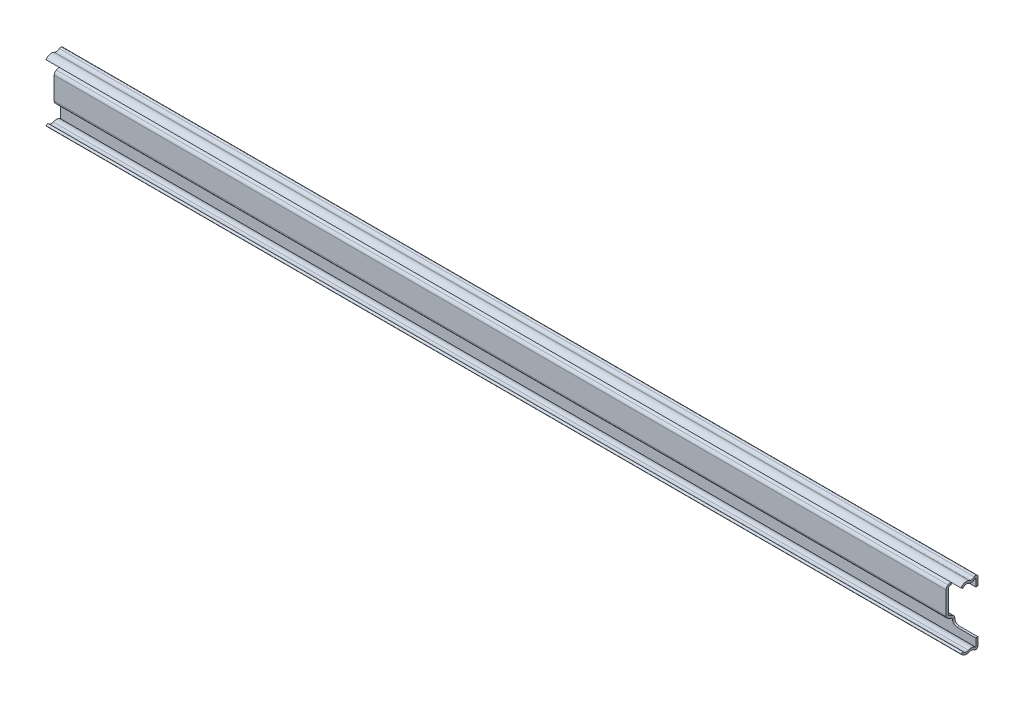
from build123d import *

# Parameters (mm, degrees)
BOSS_EXTRUDE1_DEPTH = 500.126
SKETCH2_W           = 12.7
SKETCH2_H           = 24.13
CUT_EXTRUDE1_DEPTH  = 505.455221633
SKETCH3_W           = 487.426
SKETCH3_H           = 14.75620072
BOSS_EXTRUDE2_DEPTH = 3.55599999
SKETCH4_W           = 3.55599999
SKETCH4_H           = 13.202768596
CUT_EXTRUDE2_DEPTH  = 501.46835993
DRAFT1_ANGLE        = 25
DRAFT2_ANGLE        = 25
FILLET1_R           = 0.76200009
FILLET2_R           = 1.98120009
FILLET3_R           = 2.54


with BuildPart() as part:
    # Sketch1 → Boss-Extrude1 (new body)
    with BuildSketch(Plane(origin=(-3.937, 0, 0), x_dir=(0, 0, -1), z_dir=(1, 0, 0))):
        with BuildLine():
            Line((2.311399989, 16.37657286), (2.311399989, -16.37657286))
            ThreePointArc((2.311399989, -16.37657286), (0.354826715, -15.481038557), (-1.770730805, -15.815950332))
            ThreePointArc((-1.770730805, -15.815950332), (-3.400639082, -15.955235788), (-4.710462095, -14.975253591))
            Line((-4.710462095, -14.975253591), (-5.7404, -15.627692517))
            ThreePointArc((-5.7404, -15.627692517), (-3.73586423, -17.127444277), (-1.241474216, -16.914283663))
            ThreePointArc((-1.241474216, -16.914283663), (0.188944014, -16.688900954), (1.505642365, -17.291560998))
            ThreePointArc((1.505642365, -17.291560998), (2.81343034, -17.487614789), (3.53059999, -16.37657286))
            Line((3.53059999, -16.37657286), (3.53059999, 16.37657286))
            ThreePointArc((3.53059999, 16.37657286), (2.81343034, 17.487614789), (1.505642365, 17.291560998))
            ThreePointArc((1.505642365, 17.291560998), (0.188944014, 16.688900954), (-1.241474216, 16.914283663))
            ThreePointArc((-1.241474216, 16.914283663), (-3.73586423, 17.127444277), (-5.7404, 15.627692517))
            Line((-5.7404, 15.627692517), (-4.710462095, 14.975253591))
            ThreePointArc((-4.710462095, 14.975253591), (-3.400639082, 15.955235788), (-1.770730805, 15.815950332))
            ThreePointArc((-1.770730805, 15.815950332), (0.354826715, 15.481038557), (2.311399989, 16.37657286))
        make_face()
    extrude(amount=-BOSS_EXTRUDE1_DEPTH)

    # Sketch2 → Cut-Extrude1 (cut, through all)
    with BuildSketch(Plane(origin=(0, 0, -3.53059999), x_dir=(-1, 0, 0), z_dir=(0, 0, -1))):
        with Locations((10.287, 0)):
            Rectangle(SKETCH2_W, SKETCH2_H)
    extrude(amount=-CUT_EXTRUDE1_DEPTH, mode=Mode.SUBTRACT)

    # Sketch3 → Boss-Extrude2 (add)
    with BuildSketch(Plane.XY.offset(-2.311399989)):
        with Locations((-260.35, 0)):
            Rectangle(SKETCH3_W, SKETCH3_H)
    extrude(amount=BOSS_EXTRUDE2_DEPTH)

    # Sketch4 → Cut-Extrude2 (cut, through all)
    with BuildSketch(Plane.ZY.offset(504.063)):
        with Locations((-1.752599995, 0)):
            Rectangle(SKETCH4_W, SKETCH4_H)
    extrude(amount=-CUT_EXTRUDE2_DEPTH, mode=Mode.SUBTRACT)

    # Draft1
    draft1_faces = [part.faces().sort_by_distance(p)[0] for p in [
        (-260.35, 7.37810036, -0.533399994),
        (-260.35, -7.37810036, -0.533399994),
    ]]
    draft(draft1_faces, Plane.XY.offset(1.244600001), DRAFT1_ANGLE)

    # Draft2
    draft2_faces = [part.faces().sort_by_distance(p)[0] for p in [
        (-260.35, 6.601384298, -1.752599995),
        (-260.35, -6.601384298, -1.752599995),
    ]]
    draft(draft2_faces, Plane(origin=(-3.937, -6.601384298, 0.0254), x_dir=(0, -1, 0), z_dir=(0, 0, -1)), DRAFT2_ANGLE)

    # Fillet1
    fillet1_edges = [part.edges().sort_by_distance(p)[0] for p in [
        (-260.35, -9.036290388, -2.311399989),
        (-260.35, 9.036290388, -2.311399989),
        (-260.35, 6.601384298, 0.0254),
        (-260.35, -6.601384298, 0.0254),
    ]]
    fillet(fillet1_edges, radius=FILLET1_R)

    # Fillet2
    fillet2_edges = [part.edges().sort_by_distance(p)[0] for p in [
        (-260.35, -7.37810036, 1.244600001),
        (-260.35, 7.37810036, 1.244600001),
        (-260.35, 8.259574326, -3.53059999),
        (-260.35, -8.259574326, -3.53059999),
    ]]
    fillet(fillet2_edges, radius=FILLET2_R)

    # Fillet3
    fillet3_edges = [part.edges().sort_by_distance(p)[0] for p in [
        (-16.637, 12.065, -2.92099999),
        (-16.637, -12.065, -2.92099999),
    ]]
    fillet(fillet3_edges, radius=FILLET3_R)


solid = part.part
